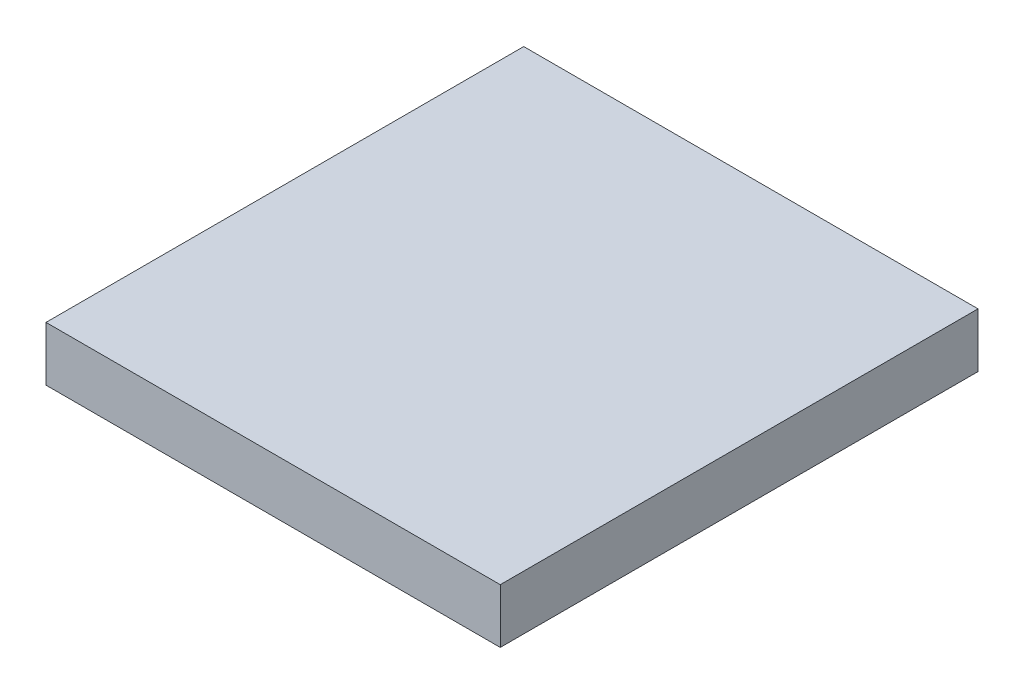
from build123d import *

# Parameters (mm, degrees)
SKIZZE1_W               = 100.257886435
SKIZZE1_H               = 105.436041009
LINEAR_AUSTRAGEN1_DEPTH = 12


with BuildPart() as part:
    # Skizze1 → Linear austragen1 (new body)
    with BuildSketch(Plane(origin=(0, 0, 0), x_dir=(1, 0, 0), z_dir=(0, 1, 0))):
        with Locations((50.128943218, 52.718020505)):
            Rectangle(SKIZZE1_W, SKIZZE1_H)
    extrude(amount=LINEAR_AUSTRAGEN1_DEPTH)


solid = part.part
